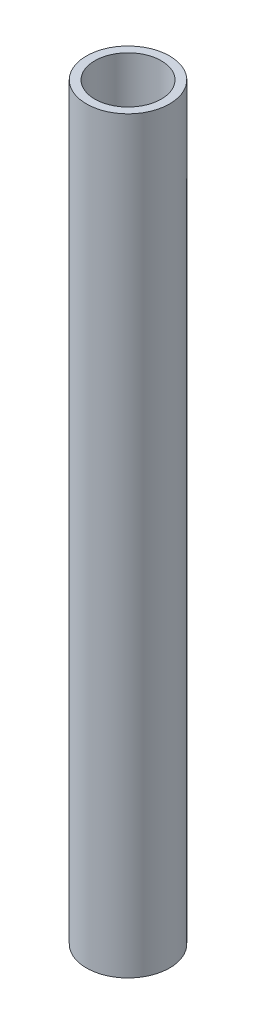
from build123d import *

# Parameters (mm, degrees)
SKETCH1_R           = 10
BOSS_EXTRUDE1_DEPTH = 180
SKETCH3_R           = 8
CUT_EXTRUDE1_DEPTH  = 180


with BuildPart() as part:
    # Sketch1 → Boss-Extrude1 (new body)
    with BuildSketch(Plane(origin=(0, 0, 0), x_dir=(1, 0, 0), z_dir=(0, 1, 0))):
        with Locations(Location((0, 0, 0), (0, 0, 90))):
            Circle(SKETCH1_R)
    extrude(amount=BOSS_EXTRUDE1_DEPTH)

    # Sketch3 → Cut-Extrude1 (cut)
    with BuildSketch(Plane(origin=(0, 180, 0), x_dir=(1, 0, 0), z_dir=(0, 1, 0))):
        with Locations(Location((0, 0, 0), (0, 0, 270))):
            Circle(SKETCH3_R)
    extrude(amount=-CUT_EXTRUDE1_DEPTH, mode=Mode.SUBTRACT)


solid = part.part
